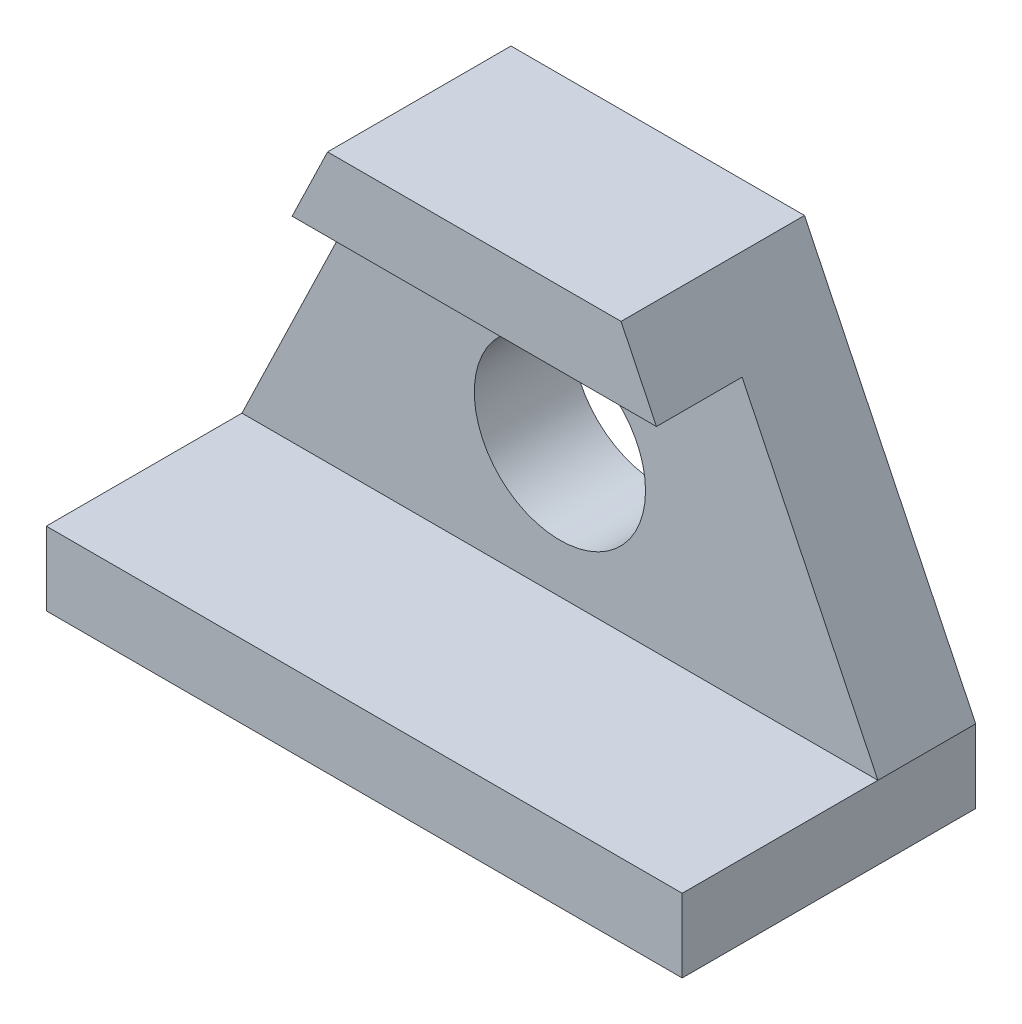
ISO-10303-21;
HEADER;
FILE_DESCRIPTION(('STEP AP214'),'2;1');
FILE_NAME('part.step','',(''),(''),'','','');
FILE_SCHEMA(('AUTOMOTIVE_DESIGN { 1 0 10303 214 1 1 1 1 }'));
ENDSEC;
DATA;
#1=APPLICATION_CONTEXT('core data for automotive mechanical design processes');
#2=APPLICATION_PROTOCOL_DEFINITION('international standard','automotive_design',2000,#1);
#3=PRODUCT_CONTEXT('',#1,'mechanical');
#4=PRODUCT('Part','Part','',(#3));
#5=PRODUCT_RELATED_PRODUCT_CATEGORY('part','',(#4));
#6=PRODUCT_DEFINITION_FORMATION('','',#4);
#7=PRODUCT_DEFINITION_CONTEXT('part definition',#1,'design');
#8=PRODUCT_DEFINITION('design','',#6,#7);
#9=PRODUCT_DEFINITION_SHAPE('','',#8);
#10=(LENGTH_UNIT() NAMED_UNIT(*) SI_UNIT(.MILLI.,.METRE.));
#11=(NAMED_UNIT(*) PLANE_ANGLE_UNIT() SI_UNIT($,.RADIAN.));
#12=(NAMED_UNIT(*) SI_UNIT($,.STERADIAN.) SOLID_ANGLE_UNIT());
#13=UNCERTAINTY_MEASURE_WITH_UNIT(LENGTH_MEASURE(1.E-05),#10,'distance_accuracy_value','');
#14=(GEOMETRIC_REPRESENTATION_CONTEXT(3) GLOBAL_UNCERTAINTY_ASSIGNED_CONTEXT((#13)) GLOBAL_UNIT_ASSIGNED_CONTEXT((#10,
#11,#12)) REPRESENTATION_CONTEXT('',''));
#15=CARTESIAN_POINT('',(0.,0.,0.));
#16=DIRECTION('',(0.,0.,1.));
#17=DIRECTION('',(1.,0.,0.));
#18=AXIS2_PLACEMENT_3D('',#15,#16,#17);
#19=CARTESIAN_POINT('',(26.,0.,0.));
#20=DIRECTION('',(0.,0.,1.));
#21=DIRECTION('',(1.,0.,0.));
#22=AXIS2_PLACEMENT_3D('',#19,#20,#21);
#23=PLANE('',#22);
#24=CARTESIAN_POINT('',(0.,17.,0.));
#25=DIRECTION('',(0.,0.,1.));
#26=DIRECTION('',(1.,0.,0.));
#27=AXIS2_PLACEMENT_3D('',#24,#25,#26);
#28=CIRCLE('',#27,7.);
#29=CARTESIAN_POINT('',(7.,17.,0.));
#30=VERTEX_POINT('',#29);
#31=EDGE_CURVE('E121',#30,#30,#28,.T.);
#32=ORIENTED_EDGE('',*,*,#31,.T.);
#33=EDGE_LOOP('',(#32));
#34=FACE_BOUND('',#33,.T.);
#35=DIRECTION('',(0.434749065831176,-0.900551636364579,0.));
#36=VECTOR('',#35,1.);
#37=CARTESIAN_POINT('',(26.,6.,0.));
#38=LINE('',#37,#36);
#39=CARTESIAN_POINT('',(12.,35.,0.));
#40=VERTEX_POINT('',#39);
#41=CARTESIAN_POINT('',(26.,6.,0.));
#42=VERTEX_POINT('',#41);
#43=EDGE_CURVE('E113',#40,#42,#38,.T.);
#44=ORIENTED_EDGE('',*,*,#43,.T.);
#45=DIRECTION('',(0.,1.,0.));
#46=VECTOR('',#45,1.);
#47=CARTESIAN_POINT('',(26.,0.,0.));
#48=LINE('',#47,#46);
#49=CARTESIAN_POINT('',(26.,0.,0.));
#50=VERTEX_POINT('',#49);
#51=EDGE_CURVE('E81',#50,#42,#48,.T.);
#52=ORIENTED_EDGE('',*,*,#51,.F.);
#53=DIRECTION('',(-1.,0.,0.));
#54=VECTOR('',#53,1.);
#55=CARTESIAN_POINT('',(26.,0.,0.));
#56=LINE('',#55,#54);
#57=CARTESIAN_POINT('',(-26.,0.,0.));
#58=VERTEX_POINT('',#57);
#59=EDGE_CURVE('E158',#50,#58,#56,.T.);
#60=ORIENTED_EDGE('',*,*,#59,.T.);
#61=DIRECTION('',(0.,1.,0.));
#62=VECTOR('',#61,1.);
#63=CARTESIAN_POINT('',(-26.,0.,0.));
#64=LINE('',#63,#62);
#65=CARTESIAN_POINT('',(-26.,6.,0.));
#66=VERTEX_POINT('',#65);
#67=EDGE_CURVE('E138',#58,#66,#64,.T.);
#68=ORIENTED_EDGE('',*,*,#67,.T.);
#69=DIRECTION('',(-0.434749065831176,-0.900551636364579,0.));
#70=VECTOR('',#69,1.);
#71=CARTESIAN_POINT('',(-26.,6.,0.));
#72=LINE('',#71,#70);
#73=CARTESIAN_POINT('',(-12.,35.,0.));
#74=VERTEX_POINT('',#73);
#75=EDGE_CURVE('E46',#74,#66,#72,.T.);
#76=ORIENTED_EDGE('',*,*,#75,.F.);
#77=DIRECTION('',(-1.,0.,0.));
#78=VECTOR('',#77,1.);
#79=CARTESIAN_POINT('',(26.,35.,0.));
#80=LINE('',#79,#78);
#81=EDGE_CURVE('E119',#40,#74,#80,.T.);
#82=ORIENTED_EDGE('',*,*,#81,.F.);
#83=EDGE_LOOP('',(#44,#52,#60,#68,#76,#82));
#84=FACE_BOUND('',#83,.T.);
#85=ADVANCED_FACE('F31',(#34,#84),#23,.F.);
#86=CARTESIAN_POINT('',(26.,35.,0.));
#87=DIRECTION('',(0.,-1.,0.));
#88=DIRECTION('',(0.,0.,-1.));
#89=AXIS2_PLACEMENT_3D('',#86,#87,#88);
#90=PLANE('',#89);
#91=DIRECTION('',(0.,0.,-1.));
#92=VECTOR('',#91,1.);
#93=CARTESIAN_POINT('',(12.,35.,52.));
#94=LINE('',#93,#92);
#95=CARTESIAN_POINT('',(12.,35.,15.));
#96=VERTEX_POINT('',#95);
#97=EDGE_CURVE('E120',#96,#40,#94,.T.);
#98=ORIENTED_EDGE('',*,*,#97,.T.);
#99=ORIENTED_EDGE('',*,*,#81,.T.);
#100=DIRECTION('',(0.,0.,-1.));
#101=VECTOR('',#100,1.);
#102=CARTESIAN_POINT('',(-12.,35.,52.));
#103=LINE('',#102,#101);
#104=CARTESIAN_POINT('',(-12.,35.,15.));
#105=VERTEX_POINT('',#104);
#106=EDGE_CURVE('E178',#105,#74,#103,.T.);
#107=ORIENTED_EDGE('',*,*,#106,.F.);
#108=DIRECTION('',(-1.,0.,0.));
#109=VECTOR('',#108,1.);
#110=CARTESIAN_POINT('',(26.,35.,15.));
#111=LINE('',#110,#109);
#112=EDGE_CURVE('E155',#96,#105,#111,.T.);
#113=ORIENTED_EDGE('',*,*,#112,.F.);
#114=EDGE_LOOP('',(#98,#99,#107,#113));
#115=FACE_BOUND('',#114,.T.);
#116=ADVANCED_FACE('F193',(#115),#90,.F.);
#117=CARTESIAN_POINT('',(26.,35.,15.));
#118=DIRECTION('',(0.,0.,-1.));
#119=DIRECTION('',(0.,1.,0.));
#120=AXIS2_PLACEMENT_3D('',#117,#118,#119);
#121=PLANE('',#120);
#122=DIRECTION('',(0.434749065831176,-0.900551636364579,0.));
#123=VECTOR('',#122,1.);
#124=CARTESIAN_POINT('',(14.6460945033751,29.5188042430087,15.));
#125=LINE('',#124,#123);
#126=CARTESIAN_POINT('',(14.8965517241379,29.,15.));
#127=VERTEX_POINT('',#126);
#128=EDGE_CURVE('E200',#96,#127,#125,.T.);
#129=ORIENTED_EDGE('',*,*,#128,.F.);
#130=ORIENTED_EDGE('',*,*,#112,.T.);
#131=DIRECTION('',(-0.434749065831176,-0.900551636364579,0.));
#132=VECTOR('',#131,1.);
#133=CARTESIAN_POINT('',(-4.81774349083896,49.877531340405,15.));
#134=LINE('',#133,#132);
#135=CARTESIAN_POINT('',(-14.8965517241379,29.,15.));
#136=VERTEX_POINT('',#135);
#137=EDGE_CURVE('E139',#105,#136,#134,.T.);
#138=ORIENTED_EDGE('',*,*,#137,.T.);
#139=DIRECTION('',(-1.,0.,0.));
#140=VECTOR('',#139,1.);
#141=CARTESIAN_POINT('',(26.,29.,15.));
#142=LINE('',#141,#140);
#143=EDGE_CURVE('E153',#127,#136,#142,.T.);
#144=ORIENTED_EDGE('',*,*,#143,.F.);
#145=EDGE_LOOP('',(#129,#130,#138,#144));
#146=FACE_BOUND('',#145,.T.);
#147=ADVANCED_FACE('F188',(#146),#121,.F.);
#148=CARTESIAN_POINT('',(26.,29.,15.));
#149=DIRECTION('',(0.,1.,0.));
#150=DIRECTION('',(0.,0.,1.));
#151=AXIS2_PLACEMENT_3D('',#148,#149,#150);
#152=PLANE('',#151);
#153=DIRECTION('',(0.,0.,-1.));
#154=VECTOR('',#153,1.);
#155=CARTESIAN_POINT('',(14.8965517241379,29.,15.));
#156=LINE('',#155,#154);
#157=CARTESIAN_POINT('',(14.8965517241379,29.,8.));
#158=VERTEX_POINT('',#157);
#159=EDGE_CURVE('E195',#127,#158,#156,.T.);
#160=ORIENTED_EDGE('',*,*,#159,.F.);
#161=ORIENTED_EDGE('',*,*,#143,.T.);
#162=DIRECTION('',(0.,0.,-1.));
#163=VECTOR('',#162,1.);
#164=CARTESIAN_POINT('',(-14.8965517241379,29.,15.));
#165=LINE('',#164,#163);
#166=CARTESIAN_POINT('',(-14.8965517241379,29.,8.));
#167=VERTEX_POINT('',#166);
#168=EDGE_CURVE('E177',#136,#167,#165,.T.);
#169=ORIENTED_EDGE('',*,*,#168,.T.);
#170=DIRECTION('',(-1.,0.,0.));
#171=VECTOR('',#170,1.);
#172=CARTESIAN_POINT('',(26.,29.,8.));
#173=LINE('',#172,#171);
#174=EDGE_CURVE('E151',#158,#167,#173,.T.);
#175=ORIENTED_EDGE('',*,*,#174,.F.);
#176=EDGE_LOOP('',(#160,#161,#169,#175));
#177=FACE_BOUND('',#176,.T.);
#178=ADVANCED_FACE('F203',(#177),#152,.F.);
#179=CARTESIAN_POINT('',(26.,29.,8.));
#180=DIRECTION('',(0.,0.,-1.));
#181=DIRECTION('',(0.,1.,0.));
#182=AXIS2_PLACEMENT_3D('',#179,#180,#181);
#183=PLANE('',#182);
#184=CARTESIAN_POINT('',(0.,17.,8.));
#185=DIRECTION('',(0.,0.,1.));
#186=DIRECTION('',(1.,0.,0.));
#187=AXIS2_PLACEMENT_3D('',#184,#185,#186);
#188=CIRCLE('',#187,7.);
#189=CARTESIAN_POINT('',(7.,17.,8.));
#190=VERTEX_POINT('',#189);
#191=EDGE_CURVE('E222',#190,#190,#188,.T.);
#192=ORIENTED_EDGE('',*,*,#191,.F.);
#193=EDGE_LOOP('',(#192));
#194=FACE_BOUND('',#193,.T.);
#195=DIRECTION('',(0.434749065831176,-0.900551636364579,0.));
#196=VECTOR('',#195,1.);
#197=CARTESIAN_POINT('',(16.9951783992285,24.6528447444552,8.));
#198=LINE('',#197,#196);
#199=CARTESIAN_POINT('',(26.,6.,8.));
#200=VERTEX_POINT('',#199);
#201=EDGE_CURVE('E116',#158,#200,#198,.T.);
#202=ORIENTED_EDGE('',*,*,#201,.F.);
#203=ORIENTED_EDGE('',*,*,#174,.T.);
#204=DIRECTION('',(-0.434749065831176,-0.900551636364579,0.));
#205=VECTOR('',#204,1.);
#206=CARTESIAN_POINT('',(-7.16682738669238,45.0115718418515,8.00000000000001));
#207=LINE('',#206,#205);
#208=CARTESIAN_POINT('',(-26.,6.,8.00000000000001));
#209=VERTEX_POINT('',#208);
#210=EDGE_CURVE('E174',#167,#209,#207,.T.);
#211=ORIENTED_EDGE('',*,*,#210,.T.);
#212=DIRECTION('',(-1.,0.,0.));
#213=VECTOR('',#212,1.);
#214=CARTESIAN_POINT('',(26.,6.,8.));
#215=LINE('',#214,#213);
#216=EDGE_CURVE('E148',#200,#209,#215,.T.);
#217=ORIENTED_EDGE('',*,*,#216,.F.);
#218=EDGE_LOOP('',(#202,#203,#211,#217));
#219=FACE_BOUND('',#218,.T.);
#220=ADVANCED_FACE('F172',(#194,#219),#183,.F.);
#221=CARTESIAN_POINT('',(26.,0.,0.));
#222=DIRECTION('',(1.,0.,0.));
#223=DIRECTION('',(0.,0.,-1.));
#224=AXIS2_PLACEMENT_3D('',#221,#222,#223);
#225=PLANE('',#224);
#226=ORIENTED_EDGE('',*,*,#51,.T.);
#227=DIRECTION('',(0.,0.,1.));
#228=VECTOR('',#227,1.);
#229=CARTESIAN_POINT('',(26.,6.,0.));
#230=LINE('',#229,#228);
#231=EDGE_CURVE('E11',#42,#200,#230,.T.);
#232=ORIENTED_EDGE('',*,*,#231,.T.);
#233=DIRECTION('',(0.,0.,1.));
#234=VECTOR('',#233,1.);
#235=CARTESIAN_POINT('',(26.,6.,8.));
#236=LINE('',#235,#234);
#237=CARTESIAN_POINT('',(26.,6.,24.));
#238=VERTEX_POINT('',#237);
#239=EDGE_CURVE('E127',#200,#238,#236,.T.);
#240=ORIENTED_EDGE('',*,*,#239,.T.);
#241=DIRECTION('',(0.,-1.,0.));
#242=VECTOR('',#241,1.);
#243=CARTESIAN_POINT('',(26.,6.,24.));
#244=LINE('',#243,#242);
#245=CARTESIAN_POINT('',(26.,0.,24.));
#246=VERTEX_POINT('',#245);
#247=EDGE_CURVE('E55',#238,#246,#244,.T.);
#248=ORIENTED_EDGE('',*,*,#247,.T.);
#249=DIRECTION('',(0.,0.,-1.));
#250=VECTOR('',#249,1.);
#251=CARTESIAN_POINT('',(26.,0.,24.));
#252=LINE('',#251,#250);
#253=EDGE_CURVE('E125',#246,#50,#252,.T.);
#254=ORIENTED_EDGE('',*,*,#253,.T.);
#255=EDGE_LOOP('',(#226,#232,#240,#248,#254));
#256=FACE_BOUND('',#255,.T.);
#257=ADVANCED_FACE('F123',(#256),#225,.T.);
#258=CARTESIAN_POINT('',(26.,0.,24.));
#259=DIRECTION('',(0.,1.,0.));
#260=DIRECTION('',(0.,0.,1.));
#261=AXIS2_PLACEMENT_3D('',#258,#259,#260);
#262=PLANE('',#261);
#263=DIRECTION('',(0.,0.,-1.));
#264=VECTOR('',#263,1.);
#265=CARTESIAN_POINT('',(-26.,0.,24.));
#266=LINE('',#265,#264);
#267=CARTESIAN_POINT('',(-26.,0.,24.));
#268=VERTEX_POINT('',#267);
#269=EDGE_CURVE('E135',#268,#58,#266,.T.);
#270=ORIENTED_EDGE('',*,*,#269,.T.);
#271=ORIENTED_EDGE('',*,*,#59,.F.);
#272=ORIENTED_EDGE('',*,*,#253,.F.);
#273=DIRECTION('',(-1.,0.,0.));
#274=VECTOR('',#273,1.);
#275=CARTESIAN_POINT('',(26.,0.,24.));
#276=LINE('',#275,#274);
#277=EDGE_CURVE('E134',#246,#268,#276,.T.);
#278=ORIENTED_EDGE('',*,*,#277,.T.);
#279=EDGE_LOOP('',(#270,#271,#272,#278));
#280=FACE_BOUND('',#279,.T.);
#281=ADVANCED_FACE('F33',(#280),#262,.F.);
#282=CARTESIAN_POINT('',(26.,6.,8.));
#283=DIRECTION('',(0.,-1.,0.));
#284=DIRECTION('',(0.,0.,-1.));
#285=AXIS2_PLACEMENT_3D('',#282,#283,#284);
#286=PLANE('',#285);
#287=DIRECTION('',(0.,0.,1.));
#288=VECTOR('',#287,1.);
#289=CARTESIAN_POINT('',(-26.,6.,8.));
#290=LINE('',#289,#288);
#291=CARTESIAN_POINT('',(-26.,6.,24.));
#292=VERTEX_POINT('',#291);
#293=EDGE_CURVE('E142',#209,#292,#290,.T.);
#294=ORIENTED_EDGE('',*,*,#293,.T.);
#295=DIRECTION('',(-1.,0.,0.));
#296=VECTOR('',#295,1.);
#297=CARTESIAN_POINT('',(26.,6.,24.));
#298=LINE('',#297,#296);
#299=EDGE_CURVE('E146',#238,#292,#298,.T.);
#300=ORIENTED_EDGE('',*,*,#299,.F.);
#301=ORIENTED_EDGE('',*,*,#239,.F.);
#302=ORIENTED_EDGE('',*,*,#216,.T.);
#303=EDGE_LOOP('',(#294,#300,#301,#302));
#304=FACE_BOUND('',#303,.T.);
#305=ADVANCED_FACE('F170',(#304),#286,.F.);
#306=CARTESIAN_POINT('',(26.,6.,24.));
#307=DIRECTION('',(0.,0.,-1.));
#308=DIRECTION('',(-1.,0.,0.));
#309=AXIS2_PLACEMENT_3D('',#306,#307,#308);
#310=PLANE('',#309);
#311=DIRECTION('',(0.,-1.,0.));
#312=VECTOR('',#311,1.);
#313=CARTESIAN_POINT('',(-26.,6.,24.));
#314=LINE('',#313,#312);
#315=EDGE_CURVE('E73',#292,#268,#314,.T.);
#316=ORIENTED_EDGE('',*,*,#315,.T.);
#317=ORIENTED_EDGE('',*,*,#277,.F.);
#318=ORIENTED_EDGE('',*,*,#247,.F.);
#319=ORIENTED_EDGE('',*,*,#299,.T.);
#320=EDGE_LOOP('',(#316,#317,#318,#319));
#321=FACE_BOUND('',#320,.T.);
#322=ADVANCED_FACE('F166',(#321),#310,.F.);
#323=CARTESIAN_POINT('',(-26.,0.,0.));
#324=DIRECTION('',(1.,0.,0.));
#325=DIRECTION('',(0.,0.,-1.));
#326=AXIS2_PLACEMENT_3D('',#323,#324,#325);
#327=PLANE('',#326);
#328=ORIENTED_EDGE('',*,*,#293,.F.);
#329=DIRECTION('',(0.,0.,-1.));
#330=VECTOR('',#329,1.);
#331=CARTESIAN_POINT('',(-26.,6.,0.));
#332=LINE('',#331,#330);
#333=EDGE_CURVE('E39',#209,#66,#332,.T.);
#334=ORIENTED_EDGE('',*,*,#333,.T.);
#335=ORIENTED_EDGE('',*,*,#67,.F.);
#336=ORIENTED_EDGE('',*,*,#269,.F.);
#337=ORIENTED_EDGE('',*,*,#315,.F.);
#338=EDGE_LOOP('',(#328,#334,#335,#336,#337));
#339=FACE_BOUND('',#338,.T.);
#340=ADVANCED_FACE('F161',(#339),#327,.F.);
#341=CARTESIAN_POINT('',(-26.,6.,52.));
#342=DIRECTION('',(0.900551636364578,-0.434749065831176,0.));
#343=DIRECTION('',(0.434749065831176,0.900551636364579,0.));
#344=AXIS2_PLACEMENT_3D('',#341,#342,#343);
#345=PLANE('',#344);
#346=ORIENTED_EDGE('',*,*,#106,.T.);
#347=ORIENTED_EDGE('',*,*,#75,.T.);
#348=ORIENTED_EDGE('',*,*,#333,.F.);
#349=ORIENTED_EDGE('',*,*,#210,.F.);
#350=ORIENTED_EDGE('',*,*,#168,.F.);
#351=ORIENTED_EDGE('',*,*,#137,.F.);
#352=EDGE_LOOP('',(#346,#347,#348,#349,#350,#351));
#353=FACE_BOUND('',#352,.T.);
#354=ADVANCED_FACE('F191',(#353),#345,.F.);
#355=CARTESIAN_POINT('',(26.,6.,52.));
#356=DIRECTION('',(0.900551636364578,0.434749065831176,0.));
#357=DIRECTION('',(-0.434749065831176,0.900551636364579,0.));
#358=AXIS2_PLACEMENT_3D('',#355,#356,#357);
#359=PLANE('',#358);
#360=ORIENTED_EDGE('',*,*,#128,.T.);
#361=ORIENTED_EDGE('',*,*,#159,.T.);
#362=ORIENTED_EDGE('',*,*,#201,.T.);
#363=ORIENTED_EDGE('',*,*,#231,.F.);
#364=ORIENTED_EDGE('',*,*,#43,.F.);
#365=ORIENTED_EDGE('',*,*,#97,.F.);
#366=EDGE_LOOP('',(#360,#361,#362,#363,#364,#365));
#367=FACE_BOUND('',#366,.T.);
#368=ADVANCED_FACE('F112',(#367),#359,.T.);
#369=CARTESIAN_POINT('',(0.,17.,0.));
#370=DIRECTION('',(0.,0.,1.));
#371=DIRECTION('',(1.,0.,0.));
#372=AXIS2_PLACEMENT_3D('',#369,#370,#371);
#373=CYLINDRICAL_SURFACE('',#372,7.);
#374=ORIENTED_EDGE('',*,*,#31,.F.);
#375=EDGE_LOOP('',(#374));
#376=FACE_BOUND('',#375,.T.);
#377=ORIENTED_EDGE('',*,*,#191,.T.);
#378=EDGE_LOOP('',(#377));
#379=FACE_BOUND('',#378,.T.);
#380=ADVANCED_FACE('F227',(#376,#379),#373,.F.);
#381=CLOSED_SHELL('',(#85,#116,#147,#178,#220,#257,#281,#305,#322,#340,#354,#368,#380));
#382=MANIFOLD_SOLID_BREP('B2',#381);
#383=ADVANCED_BREP_SHAPE_REPRESENTATION('',(#18,#382),#14);
#384=SHAPE_DEFINITION_REPRESENTATION(#9,#383);
ENDSEC;
END-ISO-10303-21;
